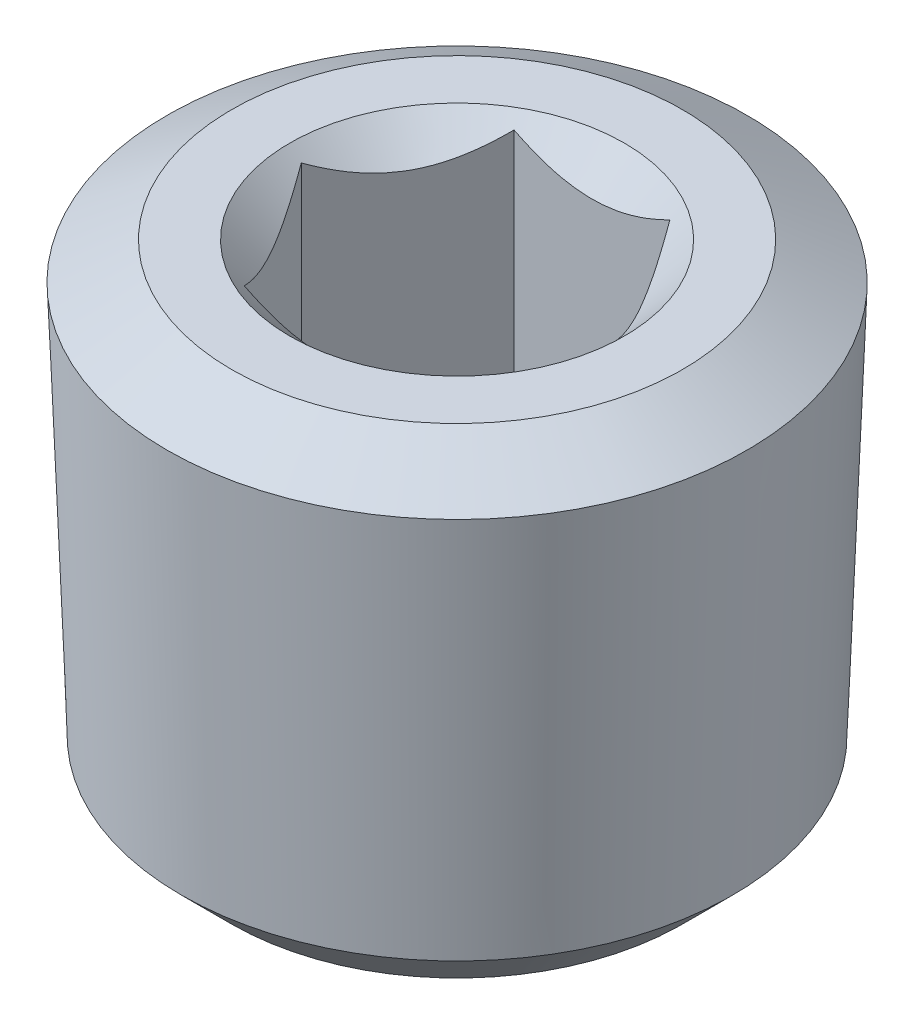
from build123d import *

# Parameters (mm, degrees)
CUT_EXTRUDE1_START = -6.35
CUT_EXTRUDE1_DEPTH = 6.079174


with BuildPart() as part:
    # Sketch2 → Revolve1 (revolve)
    with BuildSketch(Plane.XY, mode=Mode.PRIVATE) as revolve1_sk:
        Polygon((0, 0), (-5.302908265, 0), (-6.825941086, -0.879323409), (-6.489157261, -10.116751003), (-5.302908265, -11.303), (0, -11.303), align=None)
    revolve(revolve1_sk.sketch.rotate(Axis((0, 10.744282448, 0), (0, -1, 0)), 270), axis=Axis((0, 10.744282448, 0), (0, -1, 0)))

    # Sketch3 → Cut-Revolve1 (revolve, cut)
    with BuildSketch(Plane.XY, mode=Mode.PRIVATE) as cut_revolve1_sk:
        Polygon((0, 0), (-3.937, 0), (-3.175, -0.762), (-3.175, -6.35), (0, -8.257732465), align=None)
    revolve(cut_revolve1_sk.sketch.rotate(Axis((0, 2.934222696, 0), (0, -1, 0)), 270), axis=Axis((0, 2.934222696, 0), (0, -1, 0)), mode=Mode.SUBTRACT)

    # Sketch4 → Cut-Extrude1 (cut)
    with BuildSketch(Plane(origin=(0, 0, 0), x_dir=(1, 0, 0), z_dir=(0, 1, 0)).offset(CUT_EXTRUDE1_START)):
        Polygon((-1.833087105, -3.175), (1.833087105, -3.175), (3.666174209, 0), (1.833087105, 3.175), (-1.833087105, 3.175), (-3.666174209, 0), align=None)
    extrude(amount=CUT_EXTRUDE1_DEPTH, mode=Mode.SUBTRACT)


solid = part.part
